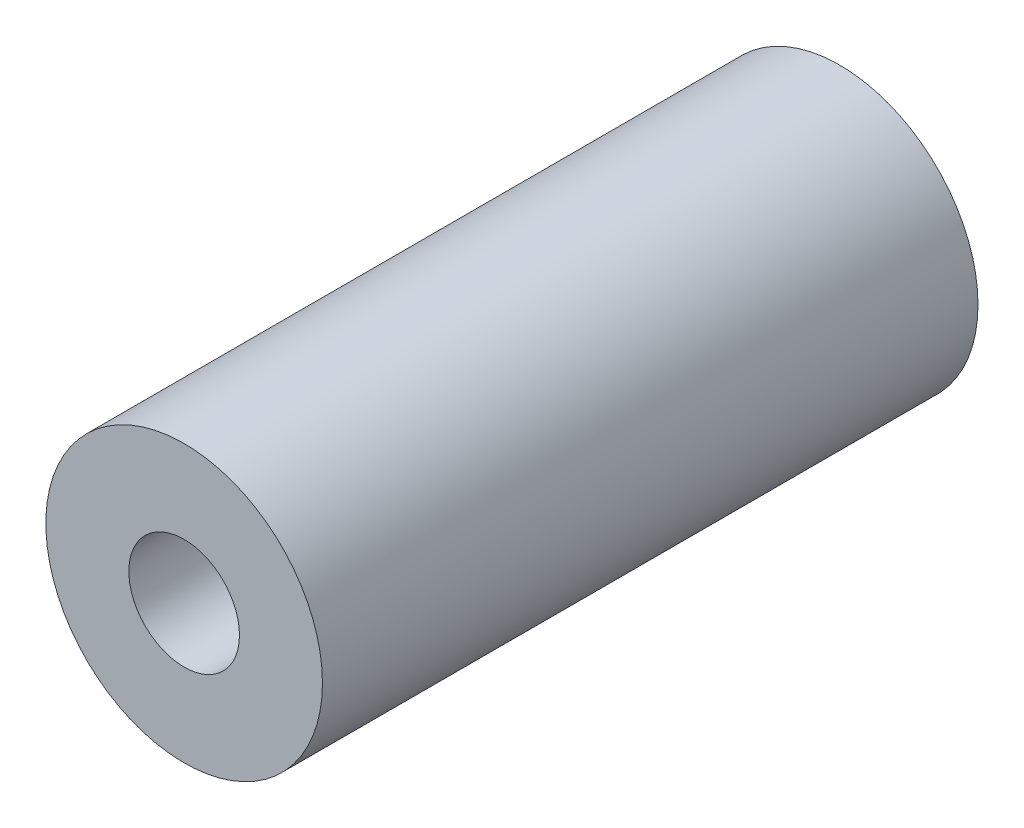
ISO-10303-21;
HEADER;
FILE_DESCRIPTION(('STEP AP214'),'2;1');
FILE_NAME('part.step','',(''),(''),'','','');
FILE_SCHEMA(('AUTOMOTIVE_DESIGN { 1 0 10303 214 1 1 1 1 }'));
ENDSEC;
DATA;
#1=APPLICATION_CONTEXT('core data for automotive mechanical design processes');
#2=APPLICATION_PROTOCOL_DEFINITION('international standard','automotive_design',2000,#1);
#3=PRODUCT_CONTEXT('',#1,'mechanical');
#4=PRODUCT('Part','Part','',(#3));
#5=PRODUCT_RELATED_PRODUCT_CATEGORY('part','',(#4));
#6=PRODUCT_DEFINITION_FORMATION('','',#4);
#7=PRODUCT_DEFINITION_CONTEXT('part definition',#1,'design');
#8=PRODUCT_DEFINITION('design','',#6,#7);
#9=PRODUCT_DEFINITION_SHAPE('','',#8);
#10=(LENGTH_UNIT() NAMED_UNIT(*) SI_UNIT(.MILLI.,.METRE.));
#11=(NAMED_UNIT(*) PLANE_ANGLE_UNIT() SI_UNIT($,.RADIAN.));
#12=(NAMED_UNIT(*) SI_UNIT($,.STERADIAN.) SOLID_ANGLE_UNIT());
#13=UNCERTAINTY_MEASURE_WITH_UNIT(LENGTH_MEASURE(1.E-05),#10,'distance_accuracy_value','');
#14=(GEOMETRIC_REPRESENTATION_CONTEXT(3) GLOBAL_UNCERTAINTY_ASSIGNED_CONTEXT((#13)) GLOBAL_UNIT_ASSIGNED_CONTEXT((#10,
#11,#12)) REPRESENTATION_CONTEXT('',''));
#15=CARTESIAN_POINT('',(0.,0.,0.));
#16=DIRECTION('',(0.,0.,1.));
#17=DIRECTION('',(1.,0.,0.));
#18=AXIS2_PLACEMENT_3D('',#15,#16,#17);
#19=CARTESIAN_POINT('',(0.,0.,118.5));
#20=DIRECTION('',(0.,0.,1.));
#21=DIRECTION('',(1.,0.,0.));
#22=AXIS2_PLACEMENT_3D('',#19,#20,#21);
#23=PLANE('',#22);
#24=CARTESIAN_POINT('',(0.,0.,118.5));
#25=DIRECTION('',(0.,0.,1.));
#26=DIRECTION('',(1.,0.,0.));
#27=AXIS2_PLACEMENT_3D('',#24,#25,#26);
#28=CIRCLE('',#27,25.);
#29=CARTESIAN_POINT('',(25.,0.,118.5));
#30=VERTEX_POINT('',#29);
#31=EDGE_CURVE('E10',#30,#30,#28,.T.);
#32=ORIENTED_EDGE('',*,*,#31,.T.);
#33=EDGE_LOOP('',(#32));
#34=FACE_BOUND('',#33,.T.);
#35=CARTESIAN_POINT('',(0.,0.,118.5));
#36=DIRECTION('',(0.,0.,1.));
#37=DIRECTION('',(1.,0.,0.));
#38=AXIS2_PLACEMENT_3D('',#35,#36,#37);
#39=CIRCLE('',#38,10.);
#40=CARTESIAN_POINT('',(10.,0.,118.5));
#41=VERTEX_POINT('',#40);
#42=EDGE_CURVE('E42',#41,#41,#39,.T.);
#43=ORIENTED_EDGE('',*,*,#42,.F.);
#44=EDGE_LOOP('',(#43));
#45=FACE_BOUND('',#44,.T.);
#46=ADVANCED_FACE('F31',(#34,#45),#23,.T.);
#47=CARTESIAN_POINT('',(0.,0.,0.));
#48=DIRECTION('',(0.,0.,1.));
#49=DIRECTION('',(1.,0.,0.));
#50=AXIS2_PLACEMENT_3D('',#47,#48,#49);
#51=PLANE('',#50);
#52=CARTESIAN_POINT('',(0.,0.,0.));
#53=DIRECTION('',(0.,0.,1.));
#54=DIRECTION('',(1.,0.,0.));
#55=AXIS2_PLACEMENT_3D('',#52,#53,#54);
#56=CIRCLE('',#55,25.);
#57=CARTESIAN_POINT('',(25.,0.,0.));
#58=VERTEX_POINT('',#57);
#59=EDGE_CURVE('E35',#58,#58,#56,.T.);
#60=ORIENTED_EDGE('',*,*,#59,.F.);
#61=EDGE_LOOP('',(#60));
#62=FACE_BOUND('',#61,.T.);
#63=CARTESIAN_POINT('',(0.,0.,0.));
#64=DIRECTION('',(0.,0.,1.));
#65=DIRECTION('',(1.,0.,0.));
#66=AXIS2_PLACEMENT_3D('',#63,#64,#65);
#67=CIRCLE('',#66,10.);
#68=CARTESIAN_POINT('',(10.,0.,0.));
#69=VERTEX_POINT('',#68);
#70=EDGE_CURVE('E44',#69,#69,#67,.T.);
#71=ORIENTED_EDGE('',*,*,#70,.T.);
#72=EDGE_LOOP('',(#71));
#73=FACE_BOUND('',#72,.T.);
#74=ADVANCED_FACE('F54',(#62,#73),#51,.F.);
#75=CARTESIAN_POINT('',(0.,0.,118.5));
#76=DIRECTION('',(0.,0.,-1.));
#77=DIRECTION('',(-1.,0.,0.));
#78=AXIS2_PLACEMENT_3D('',#75,#76,#77);
#79=CYLINDRICAL_SURFACE('',#78,25.);
#80=ORIENTED_EDGE('',*,*,#31,.F.);
#81=EDGE_LOOP('',(#80));
#82=FACE_BOUND('',#81,.T.);
#83=ORIENTED_EDGE('',*,*,#59,.T.);
#84=EDGE_LOOP('',(#83));
#85=FACE_BOUND('',#84,.T.);
#86=ADVANCED_FACE('F33',(#82,#85),#79,.T.);
#87=CARTESIAN_POINT('',(0.,0.,118.5));
#88=DIRECTION('',(0.,0.,-1.));
#89=DIRECTION('',(-1.,0.,0.));
#90=AXIS2_PLACEMENT_3D('',#87,#88,#89);
#91=CYLINDRICAL_SURFACE('',#90,10.);
#92=ORIENTED_EDGE('',*,*,#42,.T.);
#93=EDGE_LOOP('',(#92));
#94=FACE_BOUND('',#93,.T.);
#95=ORIENTED_EDGE('',*,*,#70,.F.);
#96=EDGE_LOOP('',(#95));
#97=FACE_BOUND('',#96,.T.);
#98=ADVANCED_FACE('F50',(#94,#97),#91,.F.);
#99=CLOSED_SHELL('',(#46,#74,#86,#98));
#100=MANIFOLD_SOLID_BREP('B2',#99);
#101=ADVANCED_BREP_SHAPE_REPRESENTATION('',(#18,#100),#14);
#102=SHAPE_DEFINITION_REPRESENTATION(#9,#101);
ENDSEC;
END-ISO-10303-21;
